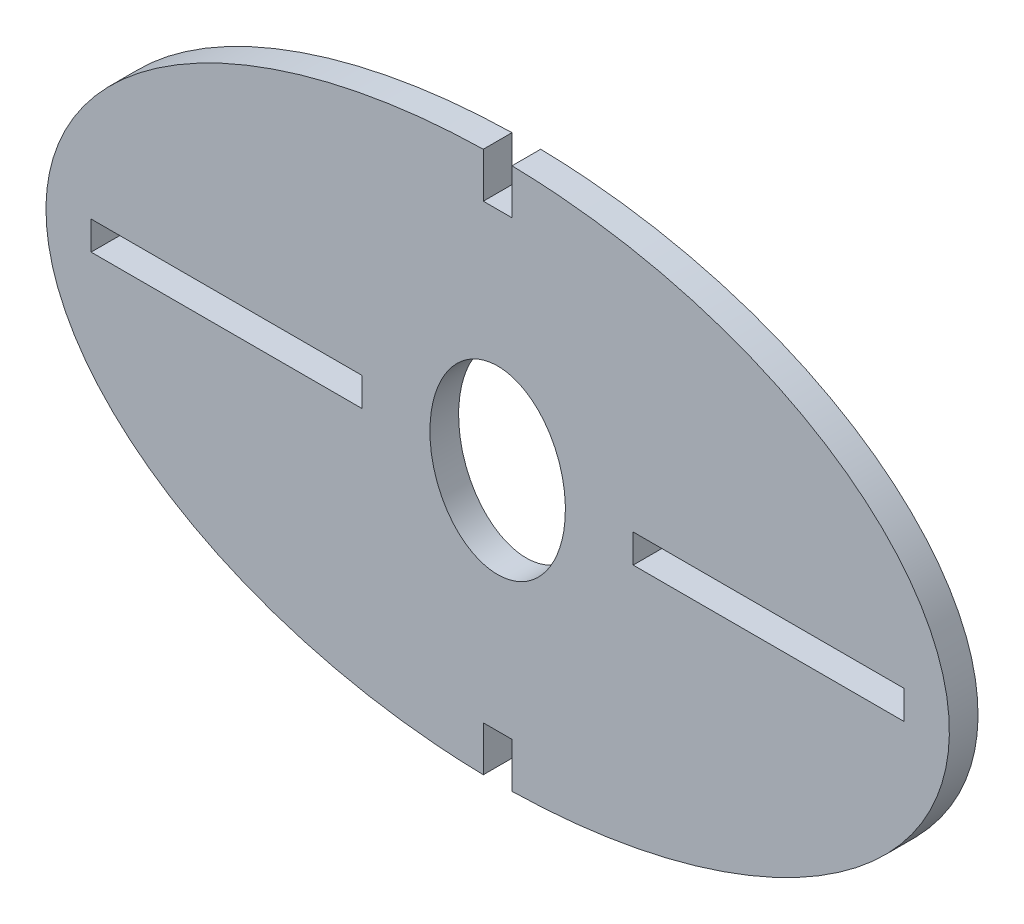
ISO-10303-21;
HEADER;
FILE_DESCRIPTION(('STEP AP214'),'2;1');
FILE_NAME('part.step','',(''),(''),'','','');
FILE_SCHEMA(('AUTOMOTIVE_DESIGN { 1 0 10303 214 1 1 1 1 }'));
ENDSEC;
DATA;
#1=APPLICATION_CONTEXT('core data for automotive mechanical design processes');
#2=APPLICATION_PROTOCOL_DEFINITION('international standard','automotive_design',2000,#1);
#3=PRODUCT_CONTEXT('',#1,'mechanical');
#4=PRODUCT('Part','Part','',(#3));
#5=PRODUCT_RELATED_PRODUCT_CATEGORY('part','',(#4));
#6=PRODUCT_DEFINITION_FORMATION('','',#4);
#7=PRODUCT_DEFINITION_CONTEXT('part definition',#1,'design');
#8=PRODUCT_DEFINITION('design','',#6,#7);
#9=PRODUCT_DEFINITION_SHAPE('','',#8);
#10=(LENGTH_UNIT() NAMED_UNIT(*) SI_UNIT(.MILLI.,.METRE.));
#11=(NAMED_UNIT(*) PLANE_ANGLE_UNIT() SI_UNIT($,.RADIAN.));
#12=(NAMED_UNIT(*) SI_UNIT($,.STERADIAN.) SOLID_ANGLE_UNIT());
#13=UNCERTAINTY_MEASURE_WITH_UNIT(LENGTH_MEASURE(1.E-05),#10,'distance_accuracy_value','');
#14=(GEOMETRIC_REPRESENTATION_CONTEXT(3) GLOBAL_UNCERTAINTY_ASSIGNED_CONTEXT((#13)) GLOBAL_UNIT_ASSIGNED_CONTEXT((#10,
#11,#12)) REPRESENTATION_CONTEXT('',''));
#15=CARTESIAN_POINT('',(0.,0.,0.));
#16=DIRECTION('',(0.,0.,1.));
#17=DIRECTION('',(1.,0.,0.));
#18=AXIS2_PLACEMENT_3D('',#15,#16,#17);
#19=CARTESIAN_POINT('',(0.,0.,3.175));
#20=DIRECTION('',(0.,0.,1.));
#21=DIRECTION('',(-1.,0.,0.));
#22=AXIS2_PLACEMENT_3D('',#19,#20,#21);
#23=ELLIPSE('',#22,50.,30.);
#24=DIRECTION('',(0.,0.,-1.));
#25=VECTOR('',#24,1.);
#26=SURFACE_OF_LINEAR_EXTRUSION('',#23,#25);
#27=CARTESIAN_POINT('',(0.,0.,0.));
#28=DIRECTION('',(0.,0.,1.));
#29=DIRECTION('',(-1.,0.,0.));
#30=AXIS2_PLACEMENT_3D('',#27,#28,#29);
#31=ELLIPSE('',#30,50.,30.);
#32=CARTESIAN_POINT('',(-1.58750000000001,29.9848752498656,0.));
#33=VERTEX_POINT('',#32);
#34=CARTESIAN_POINT('',(-1.58749999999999,-29.9848752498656,0.));
#35=VERTEX_POINT('',#34);
#36=EDGE_CURVE('E285',#33,#35,#31,.T.);
#37=ORIENTED_EDGE('',*,*,#36,.T.);
#38=DIRECTION('',(0.,0.,-1.));
#39=VECTOR('',#38,1.);
#40=CARTESIAN_POINT('',(-1.58749999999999,-29.9848752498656,3.175));
#41=LINE('',#40,#39);
#42=CARTESIAN_POINT('',(-1.58749999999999,-29.9848752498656,3.175));
#43=VERTEX_POINT('',#42);
#44=EDGE_CURVE('E41',#35,#43,#41,.F.);
#45=ORIENTED_EDGE('',*,*,#44,.T.);
#46=CARTESIAN_POINT('',(-1.5875,29.9848752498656,3.175));
#47=VERTEX_POINT('',#46);
#48=EDGE_CURVE('E289',#47,#43,#23,.T.);
#49=ORIENTED_EDGE('',*,*,#48,.F.);
#50=DIRECTION('',(0.,0.,-1.));
#51=VECTOR('',#50,1.);
#52=CARTESIAN_POINT('',(-1.5875,29.9848752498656,3.175));
#53=LINE('',#52,#51);
#54=EDGE_CURVE('E287',#47,#33,#53,.T.);
#55=ORIENTED_EDGE('',*,*,#54,.T.);
#56=EDGE_LOOP('',(#37,#45,#49,#55));
#57=FACE_BOUND('',#56,.T.);
#58=ADVANCED_FACE('F32',(#57),#26,.F.);
#59=CARTESIAN_POINT('',(0.,0.,3.175));
#60=DIRECTION('',(0.,0.,1.));
#61=DIRECTION('',(1.,0.,0.));
#62=AXIS2_PLACEMENT_3D('',#59,#60,#61);
#63=PLANE('',#62);
#64=DIRECTION('',(0.,-1.,0.));
#65=VECTOR('',#64,1.);
#66=CARTESIAN_POINT('',(-1.58749999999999,-25.,3.175));
#67=LINE('',#66,#65);
#68=CARTESIAN_POINT('',(-1.58749999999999,-25.,3.175));
#69=VERTEX_POINT('',#68);
#70=EDGE_CURVE('E160',#69,#43,#67,.T.);
#71=ORIENTED_EDGE('',*,*,#70,.F.);
#72=DIRECTION('',(-1.,0.,0.));
#73=VECTOR('',#72,1.);
#74=CARTESIAN_POINT('',(0.,-25.,3.175));
#75=LINE('',#74,#73);
#76=CARTESIAN_POINT('',(1.58750000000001,-25.,3.175));
#77=VERTEX_POINT('',#76);
#78=EDGE_CURVE('E153',#77,#69,#75,.T.);
#79=ORIENTED_EDGE('',*,*,#78,.F.);
#80=DIRECTION('',(0.,1.,0.));
#81=VECTOR('',#80,1.);
#82=CARTESIAN_POINT('',(1.58750000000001,-47.4535342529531,3.175));
#83=LINE('',#82,#81);
#84=CARTESIAN_POINT('',(1.58750000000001,-29.9848752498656,3.175));
#85=VERTEX_POINT('',#84);
#86=EDGE_CURVE('E157',#85,#77,#83,.T.);
#87=ORIENTED_EDGE('',*,*,#86,.F.);
#88=CARTESIAN_POINT('',(1.58750000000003,29.9848752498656,3.175));
#89=VERTEX_POINT('',#88);
#90=EDGE_CURVE('E56',#85,#89,#23,.T.);
#91=ORIENTED_EDGE('',*,*,#90,.T.);
#92=DIRECTION('',(0.,1.,0.));
#93=VECTOR('',#92,1.);
#94=CARTESIAN_POINT('',(1.5875,47.4535342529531,3.175));
#95=LINE('',#94,#93);
#96=CARTESIAN_POINT('',(1.5875,25.,3.175));
#97=VERTEX_POINT('',#96);
#98=EDGE_CURVE('E173',#97,#89,#95,.T.);
#99=ORIENTED_EDGE('',*,*,#98,.F.);
#100=DIRECTION('',(1.,0.,0.));
#101=VECTOR('',#100,1.);
#102=CARTESIAN_POINT('',(0.,25.,3.175));
#103=LINE('',#102,#101);
#104=CARTESIAN_POINT('',(-1.5875,25.,3.175));
#105=VERTEX_POINT('',#104);
#106=EDGE_CURVE('E178',#105,#97,#103,.T.);
#107=ORIENTED_EDGE('',*,*,#106,.F.);
#108=DIRECTION('',(0.,-1.,0.));
#109=VECTOR('',#108,1.);
#110=CARTESIAN_POINT('',(-1.5875,25.,3.175));
#111=LINE('',#110,#109);
#112=EDGE_CURVE('E175',#47,#105,#111,.T.);
#113=ORIENTED_EDGE('',*,*,#112,.F.);
#114=ORIENTED_EDGE('',*,*,#48,.T.);
#115=EDGE_LOOP('',(#71,#79,#87,#91,#99,#107,#113,#114));
#116=FACE_BOUND('',#115,.T.);
#117=CARTESIAN_POINT('',(0.,0.,3.175));
#118=DIRECTION('',(0.,0.,1.));
#119=DIRECTION('',(0.,-1.,0.));
#120=AXIS2_PLACEMENT_3D('',#117,#118,#119);
#121=ELLIPSE('',#120,10.,7.5);
#122=CARTESIAN_POINT('',(0.,-10.,3.175));
#123=VERTEX_POINT('',#122);
#124=EDGE_CURVE('E254',#123,#123,#121,.T.);
#125=ORIENTED_EDGE('',*,*,#124,.F.);
#126=EDGE_LOOP('',(#125));
#127=FACE_BOUND('',#126,.T.);
#128=DIRECTION('',(1.,0.,0.));
#129=VECTOR('',#128,1.);
#130=CARTESIAN_POINT('',(-45.,-1.58750000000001,3.175));
#131=LINE('',#130,#129);
#132=CARTESIAN_POINT('',(-45.,-1.58750000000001,3.175));
#133=VERTEX_POINT('',#132);
#134=CARTESIAN_POINT('',(-15.,-1.58750000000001,3.175));
#135=VERTEX_POINT('',#134);
#136=EDGE_CURVE('E225',#133,#135,#131,.T.);
#137=ORIENTED_EDGE('',*,*,#136,.F.);
#138=DIRECTION('',(0.,-1.,0.));
#139=VECTOR('',#138,1.);
#140=CARTESIAN_POINT('',(-45.,1.58749999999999,3.175));
#141=LINE('',#140,#139);
#142=CARTESIAN_POINT('',(-45.,1.58749999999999,3.175));
#143=VERTEX_POINT('',#142);
#144=EDGE_CURVE('E223',#143,#133,#141,.T.);
#145=ORIENTED_EDGE('',*,*,#144,.F.);
#146=DIRECTION('',(-1.,0.,0.));
#147=VECTOR('',#146,1.);
#148=CARTESIAN_POINT('',(-15.,1.5875,3.175));
#149=LINE('',#148,#147);
#150=CARTESIAN_POINT('',(-15.,1.5875,3.175));
#151=VERTEX_POINT('',#150);
#152=EDGE_CURVE('E231',#151,#143,#149,.T.);
#153=ORIENTED_EDGE('',*,*,#152,.F.);
#154=DIRECTION('',(0.,1.,0.));
#155=VECTOR('',#154,1.);
#156=CARTESIAN_POINT('',(-15.,1.5875,3.175));
#157=LINE('',#156,#155);
#158=EDGE_CURVE('E228',#135,#151,#157,.T.);
#159=ORIENTED_EDGE('',*,*,#158,.F.);
#160=EDGE_LOOP('',(#137,#145,#153,#159));
#161=FACE_BOUND('',#160,.T.);
#162=DIRECTION('',(0.,-1.,0.));
#163=VECTOR('',#162,1.);
#164=CARTESIAN_POINT('',(15.,1.5875,3.175));
#165=LINE('',#164,#163);
#166=CARTESIAN_POINT('',(15.,1.5875,3.175));
#167=VERTEX_POINT('',#166);
#168=CARTESIAN_POINT('',(15.,-1.5875,3.175));
#169=VERTEX_POINT('',#168);
#170=EDGE_CURVE('E194',#167,#169,#165,.T.);
#171=ORIENTED_EDGE('',*,*,#170,.F.);
#172=DIRECTION('',(-1.,0.,0.));
#173=VECTOR('',#172,1.);
#174=CARTESIAN_POINT('',(15.,1.5875,3.175));
#175=LINE('',#174,#173);
#176=CARTESIAN_POINT('',(45.,1.58750000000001,3.175));
#177=VERTEX_POINT('',#176);
#178=EDGE_CURVE('E192',#177,#167,#175,.T.);
#179=ORIENTED_EDGE('',*,*,#178,.F.);
#180=DIRECTION('',(0.,1.,0.));
#181=VECTOR('',#180,1.);
#182=CARTESIAN_POINT('',(45.,1.58750000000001,3.175));
#183=LINE('',#182,#181);
#184=CARTESIAN_POINT('',(45.,-1.58749999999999,3.175));
#185=VERTEX_POINT('',#184);
#186=EDGE_CURVE('E200',#185,#177,#183,.T.);
#187=ORIENTED_EDGE('',*,*,#186,.F.);
#188=DIRECTION('',(1.,0.,0.));
#189=VECTOR('',#188,1.);
#190=CARTESIAN_POINT('',(45.,-1.58749999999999,3.175));
#191=LINE('',#190,#189);
#192=EDGE_CURVE('E197',#169,#185,#191,.T.);
#193=ORIENTED_EDGE('',*,*,#192,.F.);
#194=EDGE_LOOP('',(#171,#179,#187,#193));
#195=FACE_BOUND('',#194,.T.);
#196=ADVANCED_FACE('F162',(#116,#127,#161,#195),#63,.T.);
#197=CARTESIAN_POINT('',(0.,0.,0.));
#198=DIRECTION('',(0.,0.,1.));
#199=DIRECTION('',(1.,0.,0.));
#200=AXIS2_PLACEMENT_3D('',#197,#198,#199);
#201=PLANE('',#200);
#202=DIRECTION('',(0.,-1.,0.));
#203=VECTOR('',#202,1.);
#204=CARTESIAN_POINT('',(-45.,1.58749999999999,0.));
#205=LINE('',#204,#203);
#206=CARTESIAN_POINT('',(-45.,1.58749999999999,0.));
#207=VERTEX_POINT('',#206);
#208=CARTESIAN_POINT('',(-45.,-1.58750000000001,0.));
#209=VERTEX_POINT('',#208);
#210=EDGE_CURVE('E222',#207,#209,#205,.T.);
#211=ORIENTED_EDGE('',*,*,#210,.T.);
#212=DIRECTION('',(1.,0.,0.));
#213=VECTOR('',#212,1.);
#214=CARTESIAN_POINT('',(-45.,-1.58750000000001,0.));
#215=LINE('',#214,#213);
#216=CARTESIAN_POINT('',(-15.,-1.58750000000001,0.));
#217=VERTEX_POINT('',#216);
#218=EDGE_CURVE('E236',#209,#217,#215,.T.);
#219=ORIENTED_EDGE('',*,*,#218,.T.);
#220=DIRECTION('',(0.,1.,0.));
#221=VECTOR('',#220,1.);
#222=CARTESIAN_POINT('',(-15.,1.5875,0.));
#223=LINE('',#222,#221);
#224=CARTESIAN_POINT('',(-15.,1.5875,0.));
#225=VERTEX_POINT('',#224);
#226=EDGE_CURVE('E239',#217,#225,#223,.T.);
#227=ORIENTED_EDGE('',*,*,#226,.T.);
#228=DIRECTION('',(-1.,0.,0.));
#229=VECTOR('',#228,1.);
#230=CARTESIAN_POINT('',(-15.,1.5875,0.));
#231=LINE('',#230,#229);
#232=EDGE_CURVE('E226',#225,#207,#231,.T.);
#233=ORIENTED_EDGE('',*,*,#232,.T.);
#234=EDGE_LOOP('',(#211,#219,#227,#233));
#235=FACE_BOUND('',#234,.T.);
#236=DIRECTION('',(-1.,0.,0.));
#237=VECTOR('',#236,1.);
#238=CARTESIAN_POINT('',(0.,-25.,0.));
#239=LINE('',#238,#237);
#240=CARTESIAN_POINT('',(1.58750000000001,-25.,0.));
#241=VERTEX_POINT('',#240);
#242=CARTESIAN_POINT('',(-1.58749999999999,-25.,0.));
#243=VERTEX_POINT('',#242);
#244=EDGE_CURVE('E11',#241,#243,#239,.T.);
#245=ORIENTED_EDGE('',*,*,#244,.T.);
#246=DIRECTION('',(0.,-1.,0.));
#247=VECTOR('',#246,1.);
#248=CARTESIAN_POINT('',(-1.5875,0.,0.));
#249=LINE('',#248,#247);
#250=EDGE_CURVE('E170',#243,#35,#249,.T.);
#251=ORIENTED_EDGE('',*,*,#250,.T.);
#252=ORIENTED_EDGE('',*,*,#36,.F.);
#253=DIRECTION('',(0.,-1.,0.));
#254=VECTOR('',#253,1.);
#255=CARTESIAN_POINT('',(-1.5875,0.,0.));
#256=LINE('',#255,#254);
#257=CARTESIAN_POINT('',(-1.5875,25.,0.));
#258=VERTEX_POINT('',#257);
#259=EDGE_CURVE('E188',#33,#258,#256,.T.);
#260=ORIENTED_EDGE('',*,*,#259,.T.);
#261=DIRECTION('',(1.,0.,0.));
#262=VECTOR('',#261,1.);
#263=CARTESIAN_POINT('',(0.,25.,0.));
#264=LINE('',#263,#262);
#265=CARTESIAN_POINT('',(1.5875,25.,0.));
#266=VERTEX_POINT('',#265);
#267=EDGE_CURVE('E296',#258,#266,#264,.T.);
#268=ORIENTED_EDGE('',*,*,#267,.T.);
#269=DIRECTION('',(0.,1.,0.));
#270=VECTOR('',#269,1.);
#271=CARTESIAN_POINT('',(1.5875,0.,0.));
#272=LINE('',#271,#270);
#273=CARTESIAN_POINT('',(1.58750000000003,29.9848752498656,0.));
#274=VERTEX_POINT('',#273);
#275=EDGE_CURVE('E184',#266,#274,#272,.T.);
#276=ORIENTED_EDGE('',*,*,#275,.T.);
#277=CARTESIAN_POINT('',(1.5875,-29.9848752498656,0.));
#278=VERTEX_POINT('',#277);
#279=EDGE_CURVE('E258',#278,#274,#31,.T.);
#280=ORIENTED_EDGE('',*,*,#279,.F.);
#281=DIRECTION('',(0.,1.,0.));
#282=VECTOR('',#281,1.);
#283=CARTESIAN_POINT('',(1.5875,0.,0.));
#284=LINE('',#283,#282);
#285=EDGE_CURVE('E48',#278,#241,#284,.T.);
#286=ORIENTED_EDGE('',*,*,#285,.T.);
#287=EDGE_LOOP('',(#245,#251,#252,#260,#268,#276,#280,#286));
#288=FACE_BOUND('',#287,.T.);
#289=CARTESIAN_POINT('',(0.,0.,0.));
#290=DIRECTION('',(0.,0.,1.));
#291=DIRECTION('',(0.,-1.,0.));
#292=AXIS2_PLACEMENT_3D('',#289,#290,#291);
#293=ELLIPSE('',#292,10.,7.5);
#294=CARTESIAN_POINT('',(0.,-10.,0.));
#295=VERTEX_POINT('',#294);
#296=EDGE_CURVE('E253',#295,#295,#293,.T.);
#297=ORIENTED_EDGE('',*,*,#296,.T.);
#298=EDGE_LOOP('',(#297));
#299=FACE_BOUND('',#298,.T.);
#300=DIRECTION('',(-1.,0.,0.));
#301=VECTOR('',#300,1.);
#302=CARTESIAN_POINT('',(15.,1.5875,0.));
#303=LINE('',#302,#301);
#304=CARTESIAN_POINT('',(45.,1.58750000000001,0.));
#305=VERTEX_POINT('',#304);
#306=CARTESIAN_POINT('',(15.,1.5875,0.));
#307=VERTEX_POINT('',#306);
#308=EDGE_CURVE('E191',#305,#307,#303,.T.);
#309=ORIENTED_EDGE('',*,*,#308,.T.);
#310=DIRECTION('',(0.,-1.,0.));
#311=VECTOR('',#310,1.);
#312=CARTESIAN_POINT('',(15.,1.5875,0.));
#313=LINE('',#312,#311);
#314=CARTESIAN_POINT('',(15.,-1.5875,0.));
#315=VERTEX_POINT('',#314);
#316=EDGE_CURVE('E205',#307,#315,#313,.T.);
#317=ORIENTED_EDGE('',*,*,#316,.T.);
#318=DIRECTION('',(1.,0.,0.));
#319=VECTOR('',#318,1.);
#320=CARTESIAN_POINT('',(45.,-1.58749999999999,0.));
#321=LINE('',#320,#319);
#322=CARTESIAN_POINT('',(45.,-1.58749999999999,0.));
#323=VERTEX_POINT('',#322);
#324=EDGE_CURVE('E208',#315,#323,#321,.T.);
#325=ORIENTED_EDGE('',*,*,#324,.T.);
#326=DIRECTION('',(0.,1.,0.));
#327=VECTOR('',#326,1.);
#328=CARTESIAN_POINT('',(45.,1.58750000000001,0.));
#329=LINE('',#328,#327);
#330=EDGE_CURVE('E195',#323,#305,#329,.T.);
#331=ORIENTED_EDGE('',*,*,#330,.T.);
#332=EDGE_LOOP('',(#309,#317,#325,#331));
#333=FACE_BOUND('',#332,.T.);
#334=ADVANCED_FACE('F268',(#235,#288,#299,#333),#201,.F.);
#335=ORIENTED_EDGE('',*,*,#90,.F.);
#336=DIRECTION('',(0.,0.,-1.));
#337=VECTOR('',#336,1.);
#338=CARTESIAN_POINT('',(1.58750000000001,-29.9848752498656,3.175));
#339=LINE('',#338,#337);
#340=EDGE_CURVE('E159',#85,#278,#339,.T.);
#341=ORIENTED_EDGE('',*,*,#340,.T.);
#342=ORIENTED_EDGE('',*,*,#279,.T.);
#343=DIRECTION('',(0.,0.,-1.));
#344=VECTOR('',#343,1.);
#345=CARTESIAN_POINT('',(1.5875,29.9848752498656,3.175));
#346=LINE('',#345,#344);
#347=EDGE_CURVE('E292',#274,#89,#346,.F.);
#348=ORIENTED_EDGE('',*,*,#347,.T.);
#349=EDGE_LOOP('',(#335,#341,#342,#348));
#350=FACE_BOUND('',#349,.T.);
#351=ADVANCED_FACE('F34',(#350),#26,.F.);
#352=DIRECTION('',(0.,0.,-1.));
#353=VECTOR('',#352,1.);
#354=SURFACE_OF_LINEAR_EXTRUSION('',#121,#353);
#355=ORIENTED_EDGE('',*,*,#124,.T.);
#356=EDGE_LOOP('',(#355));
#357=FACE_BOUND('',#356,.T.);
#358=ORIENTED_EDGE('',*,*,#296,.F.);
#359=EDGE_LOOP('',(#358));
#360=FACE_BOUND('',#359,.T.);
#361=ADVANCED_FACE('F260',(#357,#360),#354,.T.);
#362=CARTESIAN_POINT('',(-45.,1.58749999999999,3.175));
#363=DIRECTION('',(1.,0.,0.));
#364=DIRECTION('',(0.,0.,-1.));
#365=AXIS2_PLACEMENT_3D('',#362,#363,#364);
#366=PLANE('',#365);
#367=ORIENTED_EDGE('',*,*,#210,.F.);
#368=DIRECTION('',(0.,0.,-1.));
#369=VECTOR('',#368,1.);
#370=CARTESIAN_POINT('',(-45.,1.58749999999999,3.175));
#371=LINE('',#370,#369);
#372=EDGE_CURVE('E233',#143,#207,#371,.T.);
#373=ORIENTED_EDGE('',*,*,#372,.F.);
#374=ORIENTED_EDGE('',*,*,#144,.T.);
#375=DIRECTION('',(0.,0.,-1.));
#376=VECTOR('',#375,1.);
#377=CARTESIAN_POINT('',(-45.,-1.58750000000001,3.175));
#378=LINE('',#377,#376);
#379=EDGE_CURVE('E250',#133,#209,#378,.T.);
#380=ORIENTED_EDGE('',*,*,#379,.T.);
#381=EDGE_LOOP('',(#367,#373,#374,#380));
#382=FACE_BOUND('',#381,.T.);
#383=ADVANCED_FACE('F264',(#382),#366,.T.);
#384=CARTESIAN_POINT('',(-45.,-1.58750000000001,3.175));
#385=DIRECTION('',(0.,1.,0.));
#386=DIRECTION('',(0.,0.,1.));
#387=AXIS2_PLACEMENT_3D('',#384,#385,#386);
#388=PLANE('',#387);
#389=ORIENTED_EDGE('',*,*,#218,.F.);
#390=ORIENTED_EDGE('',*,*,#379,.F.);
#391=ORIENTED_EDGE('',*,*,#136,.T.);
#392=DIRECTION('',(0.,0.,-1.));
#393=VECTOR('',#392,1.);
#394=CARTESIAN_POINT('',(-15.,-1.58750000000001,3.175));
#395=LINE('',#394,#393);
#396=EDGE_CURVE('E248',#135,#217,#395,.T.);
#397=ORIENTED_EDGE('',*,*,#396,.T.);
#398=EDGE_LOOP('',(#389,#390,#391,#397));
#399=FACE_BOUND('',#398,.T.);
#400=ADVANCED_FACE('F344',(#399),#388,.T.);
#401=CARTESIAN_POINT('',(-15.,1.5875,3.175));
#402=DIRECTION('',(-1.,0.,0.));
#403=DIRECTION('',(0.,0.,1.));
#404=AXIS2_PLACEMENT_3D('',#401,#402,#403);
#405=PLANE('',#404);
#406=ORIENTED_EDGE('',*,*,#226,.F.);
#407=ORIENTED_EDGE('',*,*,#396,.F.);
#408=ORIENTED_EDGE('',*,*,#158,.T.);
#409=DIRECTION('',(0.,0.,-1.));
#410=VECTOR('',#409,1.);
#411=CARTESIAN_POINT('',(-15.,1.5875,3.175));
#412=LINE('',#411,#410);
#413=EDGE_CURVE('E246',#151,#225,#412,.T.);
#414=ORIENTED_EDGE('',*,*,#413,.T.);
#415=EDGE_LOOP('',(#406,#407,#408,#414));
#416=FACE_BOUND('',#415,.T.);
#417=ADVANCED_FACE('F341',(#416),#405,.T.);
#418=CARTESIAN_POINT('',(-15.,1.5875,3.175));
#419=DIRECTION('',(0.,-1.,0.));
#420=DIRECTION('',(1.,0.,0.));
#421=AXIS2_PLACEMENT_3D('',#418,#419,#420);
#422=PLANE('',#421);
#423=ORIENTED_EDGE('',*,*,#232,.F.);
#424=ORIENTED_EDGE('',*,*,#413,.F.);
#425=ORIENTED_EDGE('',*,*,#152,.T.);
#426=ORIENTED_EDGE('',*,*,#372,.T.);
#427=EDGE_LOOP('',(#423,#424,#425,#426));
#428=FACE_BOUND('',#427,.T.);
#429=ADVANCED_FACE('F337',(#428),#422,.T.);
#430=CARTESIAN_POINT('',(15.,1.5875,3.175));
#431=DIRECTION('',(0.,-1.,0.));
#432=DIRECTION('',(1.,0.,0.));
#433=AXIS2_PLACEMENT_3D('',#430,#431,#432);
#434=PLANE('',#433);
#435=ORIENTED_EDGE('',*,*,#308,.F.);
#436=DIRECTION('',(0.,0.,-1.));
#437=VECTOR('',#436,1.);
#438=CARTESIAN_POINT('',(45.,1.58750000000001,3.175));
#439=LINE('',#438,#437);
#440=EDGE_CURVE('E202',#177,#305,#439,.T.);
#441=ORIENTED_EDGE('',*,*,#440,.F.);
#442=ORIENTED_EDGE('',*,*,#178,.T.);
#443=DIRECTION('',(0.,0.,-1.));
#444=VECTOR('',#443,1.);
#445=CARTESIAN_POINT('',(15.,1.5875,3.175));
#446=LINE('',#445,#444);
#447=EDGE_CURVE('E219',#167,#307,#446,.T.);
#448=ORIENTED_EDGE('',*,*,#447,.T.);
#449=EDGE_LOOP('',(#435,#441,#442,#448));
#450=FACE_BOUND('',#449,.T.);
#451=ADVANCED_FACE('F333',(#450),#434,.T.);
#452=CARTESIAN_POINT('',(15.,1.5875,3.175));
#453=DIRECTION('',(1.,0.,0.));
#454=DIRECTION('',(0.,0.,-1.));
#455=AXIS2_PLACEMENT_3D('',#452,#453,#454);
#456=PLANE('',#455);
#457=ORIENTED_EDGE('',*,*,#316,.F.);
#458=ORIENTED_EDGE('',*,*,#447,.F.);
#459=ORIENTED_EDGE('',*,*,#170,.T.);
#460=DIRECTION('',(0.,0.,-1.));
#461=VECTOR('',#460,1.);
#462=CARTESIAN_POINT('',(15.,-1.5875,3.175));
#463=LINE('',#462,#461);
#464=EDGE_CURVE('E217',#169,#315,#463,.T.);
#465=ORIENTED_EDGE('',*,*,#464,.T.);
#466=EDGE_LOOP('',(#457,#458,#459,#465));
#467=FACE_BOUND('',#466,.T.);
#468=ADVANCED_FACE('F329',(#467),#456,.T.);
#469=CARTESIAN_POINT('',(45.,-1.58749999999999,3.175));
#470=DIRECTION('',(0.,1.,0.));
#471=DIRECTION('',(-1.,0.,0.));
#472=AXIS2_PLACEMENT_3D('',#469,#470,#471);
#473=PLANE('',#472);
#474=ORIENTED_EDGE('',*,*,#324,.F.);
#475=ORIENTED_EDGE('',*,*,#464,.F.);
#476=ORIENTED_EDGE('',*,*,#192,.T.);
#477=DIRECTION('',(0.,0.,-1.));
#478=VECTOR('',#477,1.);
#479=CARTESIAN_POINT('',(45.,-1.58749999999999,3.175));
#480=LINE('',#479,#478);
#481=EDGE_CURVE('E215',#185,#323,#480,.T.);
#482=ORIENTED_EDGE('',*,*,#481,.T.);
#483=EDGE_LOOP('',(#474,#475,#476,#482));
#484=FACE_BOUND('',#483,.T.);
#485=ADVANCED_FACE('F325',(#484),#473,.T.);
#486=CARTESIAN_POINT('',(45.,1.58750000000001,3.175));
#487=DIRECTION('',(-1.,0.,0.));
#488=DIRECTION('',(0.,0.,1.));
#489=AXIS2_PLACEMENT_3D('',#486,#487,#488);
#490=PLANE('',#489);
#491=ORIENTED_EDGE('',*,*,#330,.F.);
#492=ORIENTED_EDGE('',*,*,#481,.F.);
#493=ORIENTED_EDGE('',*,*,#186,.T.);
#494=ORIENTED_EDGE('',*,*,#440,.T.);
#495=EDGE_LOOP('',(#491,#492,#493,#494));
#496=FACE_BOUND('',#495,.T.);
#497=ADVANCED_FACE('F319',(#496),#490,.T.);
#498=CARTESIAN_POINT('',(0.,25.,-6.825));
#499=DIRECTION('',(0.,-1.,0.));
#500=DIRECTION('',(0.,0.,-1.));
#501=AXIS2_PLACEMENT_3D('',#498,#499,#500);
#502=PLANE('',#501);
#503=DIRECTION('',(0.,0.,1.));
#504=VECTOR('',#503,1.);
#505=CARTESIAN_POINT('',(-1.5875,25.,-6.825));
#506=LINE('',#505,#504);
#507=EDGE_CURVE('E182',#258,#105,#506,.T.);
#508=ORIENTED_EDGE('',*,*,#507,.T.);
#509=ORIENTED_EDGE('',*,*,#106,.T.);
#510=DIRECTION('',(0.,0.,1.));
#511=VECTOR('',#510,1.);
#512=CARTESIAN_POINT('',(1.5875,25.,-6.825));
#513=LINE('',#512,#511);
#514=EDGE_CURVE('E181',#266,#97,#513,.T.);
#515=ORIENTED_EDGE('',*,*,#514,.F.);
#516=ORIENTED_EDGE('',*,*,#267,.F.);
#517=EDGE_LOOP('',(#508,#509,#515,#516));
#518=FACE_BOUND('',#517,.T.);
#519=ADVANCED_FACE('F306',(#518),#502,.F.);
#520=CARTESIAN_POINT('',(-1.5875,25.,-6.825));
#521=DIRECTION('',(-1.,0.,0.));
#522=DIRECTION('',(0.,0.,1.));
#523=AXIS2_PLACEMENT_3D('',#520,#521,#522);
#524=PLANE('',#523);
#525=ORIENTED_EDGE('',*,*,#54,.F.);
#526=ORIENTED_EDGE('',*,*,#112,.T.);
#527=ORIENTED_EDGE('',*,*,#507,.F.);
#528=ORIENTED_EDGE('',*,*,#259,.F.);
#529=EDGE_LOOP('',(#525,#526,#527,#528));
#530=FACE_BOUND('',#529,.T.);
#531=ADVANCED_FACE('F311',(#530),#524,.F.);
#532=CARTESIAN_POINT('',(1.5875,47.4535342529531,-6.825));
#533=DIRECTION('',(1.,0.,0.));
#534=DIRECTION('',(0.,1.,0.));
#535=AXIS2_PLACEMENT_3D('',#532,#533,#534);
#536=PLANE('',#535);
#537=ORIENTED_EDGE('',*,*,#514,.T.);
#538=ORIENTED_EDGE('',*,*,#98,.T.);
#539=ORIENTED_EDGE('',*,*,#347,.F.);
#540=ORIENTED_EDGE('',*,*,#275,.F.);
#541=EDGE_LOOP('',(#537,#538,#539,#540));
#542=FACE_BOUND('',#541,.T.);
#543=ADVANCED_FACE('F304',(#542),#536,.F.);
#544=CARTESIAN_POINT('',(0.,-25.,-6.825));
#545=DIRECTION('',(0.,1.,0.));
#546=DIRECTION('',(0.,0.,1.));
#547=AXIS2_PLACEMENT_3D('',#544,#545,#546);
#548=PLANE('',#547);
#549=DIRECTION('',(0.,0.,1.));
#550=VECTOR('',#549,1.);
#551=CARTESIAN_POINT('',(1.58750000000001,-25.,-6.825));
#552=LINE('',#551,#550);
#553=EDGE_CURVE('E148',#241,#77,#552,.T.);
#554=ORIENTED_EDGE('',*,*,#553,.T.);
#555=ORIENTED_EDGE('',*,*,#78,.T.);
#556=DIRECTION('',(0.,0.,1.));
#557=VECTOR('',#556,1.);
#558=CARTESIAN_POINT('',(-1.58749999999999,-25.,-6.825));
#559=LINE('',#558,#557);
#560=EDGE_CURVE('E155',#243,#69,#559,.T.);
#561=ORIENTED_EDGE('',*,*,#560,.F.);
#562=ORIENTED_EDGE('',*,*,#244,.F.);
#563=EDGE_LOOP('',(#554,#555,#561,#562));
#564=FACE_BOUND('',#563,.T.);
#565=ADVANCED_FACE('F150',(#564),#548,.F.);
#566=CARTESIAN_POINT('',(-1.58749999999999,-25.,-6.825));
#567=DIRECTION('',(-1.,0.,0.));
#568=DIRECTION('',(0.,-1.,0.));
#569=AXIS2_PLACEMENT_3D('',#566,#567,#568);
#570=PLANE('',#569);
#571=ORIENTED_EDGE('',*,*,#560,.T.);
#572=ORIENTED_EDGE('',*,*,#70,.T.);
#573=ORIENTED_EDGE('',*,*,#44,.F.);
#574=ORIENTED_EDGE('',*,*,#250,.F.);
#575=EDGE_LOOP('',(#571,#572,#573,#574));
#576=FACE_BOUND('',#575,.T.);
#577=ADVANCED_FACE('F421',(#576),#570,.F.);
#578=CARTESIAN_POINT('',(1.58750000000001,-47.4535342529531,-6.825));
#579=DIRECTION('',(1.,0.,0.));
#580=DIRECTION('',(0.,1.,0.));
#581=AXIS2_PLACEMENT_3D('',#578,#579,#580);
#582=PLANE('',#581);
#583=ORIENTED_EDGE('',*,*,#340,.F.);
#584=ORIENTED_EDGE('',*,*,#86,.T.);
#585=ORIENTED_EDGE('',*,*,#553,.F.);
#586=ORIENTED_EDGE('',*,*,#285,.F.);
#587=EDGE_LOOP('',(#583,#584,#585,#586));
#588=FACE_BOUND('',#587,.T.);
#589=ADVANCED_FACE('F158',(#588),#582,.F.);
#590=CLOSED_SHELL('',(#58,#196,#334,#351,#361,#383,#400,#417,#429,#451,#468,#485,#497,#519,#531,
#543,#565,#577,#589));
#591=MANIFOLD_SOLID_BREP('B2',#590);
#592=ADVANCED_BREP_SHAPE_REPRESENTATION('',(#18,#591),#14);
#593=SHAPE_DEFINITION_REPRESENTATION(#9,#592);
ENDSEC;
END-ISO-10303-21;
